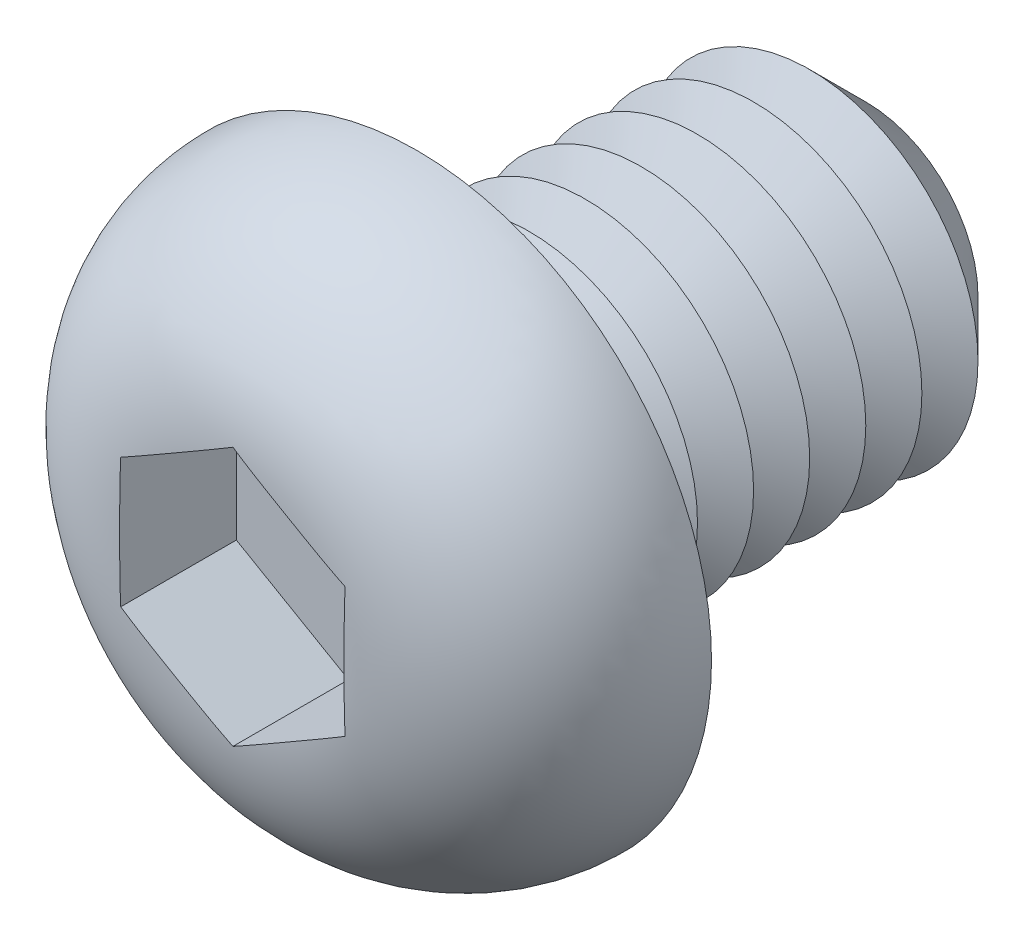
from build123d import *

# Parameters (mm, degrees)
CUT_EXTRUDE1_DEPTH  = 2.08
SKETCH4_R           = 3
BOSS_EXTRUDE1_DEPTH = 8
CHAMFER1_SIZE       = 1
LPATTERN1_COUNT     = 6
LPATTERN1_PITCH     = 1
FILLET2_R           = 0.5
SKETCH6_R           = 0.8
CUT_EXTRUDE2_DEPTH  = 9.22


with BuildPart() as part:
    # Sketch2 → Revolve1 (revolve)
    with BuildSketch(Plane(origin=(0, 0, 0), x_dir=(0, 0, -1), z_dir=(1, 0, 0)), mode=Mode.PRIVATE) as revolve1_sk:
        with BuildLine():
            Line((0, 0), (-3.3, 0))
            Line((-3.3, 0), (-3.3, 1.95))
            ThreePointArc((-3.3, 1.95), (-2.333452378, 4.283452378), (0, 5.25))
            Line((0, 5.25), (0, 0))
        make_face()
    revolve(revolve1_sk.sketch.rotate(Axis((0, 0, 47.934239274), (0, 0, -1)), 90), axis=Axis((0, 0, 47.934239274), (0, 0, -1)))

    # Sketch3 → Cut-Extrude1 (cut)
    with BuildSketch(Plane.XY.offset(3.3)):
        Polygon((0, 2.309401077), (-2, 1.154700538), (-2, -1.154700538), (0, -2.309401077), (2, -1.154700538), (2, 1.154700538), align=None)
    extrude(amount=-CUT_EXTRUDE1_DEPTH, mode=Mode.SUBTRACT)

    # Sketch4 → Boss-Extrude1 (add)
    with BuildSketch(Plane(origin=(0, 0, 0), x_dir=(-1, 0, 0), z_dir=(0, 0, -1))):
        with Locations(Location((0, 0, 0), (0, 0, 180))):
            Circle(SKETCH4_R)
    extrude(amount=BOSS_EXTRUDE1_DEPTH)

    # Chamfer1
    chamfer1_edges = [part.edges().sort_by_distance(p)[0] for p in [
        (-3, 0, -8),
    ]]
    chamfer(chamfer1_edges, length=CHAMFER1_SIZE)

    # Sketch5 → Cut-Revolve1 (revolve, cut)
    with BuildSketch(Plane(origin=(0, 0, 0), x_dir=(0, 0, -1), z_dir=(1, 0, 0)), mode=Mode.PRIVATE) as cut_revolve1_sk:
        Polygon((1, 3), (2, 3), (1.5, 2.133974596), align=None)
    cut_revolve1 = revolve(cut_revolve1_sk.sketch.rotate(Axis((0, 0, 47.934239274), (0, 0, -1)), 90), axis=Axis((0, 0, 47.934239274), (0, 0, -1)), mode=Mode.SUBTRACT)

    # LPattern1: Cut-Revolve1 ×6
    with Locations(*[(0, 0, -i * LPATTERN1_PITCH) for i in range(1, LPATTERN1_COUNT)]):
        add(cut_revolve1, mode=Mode.SUBTRACT)

    # Fillet2
    fillet2_edges = [part.edges().sort_by_distance(p)[0] for p in [
        (-3, 0, 0),
    ]]
    fillet(fillet2_edges, radius=FILLET2_R)

    # Sketch6 → Cut-Extrude2 (cut)
    with BuildSketch(Plane.XY.offset(1.22)):
        Circle(SKETCH6_R)
    extrude(amount=-CUT_EXTRUDE2_DEPTH, mode=Mode.SUBTRACT)


solid = part.part
